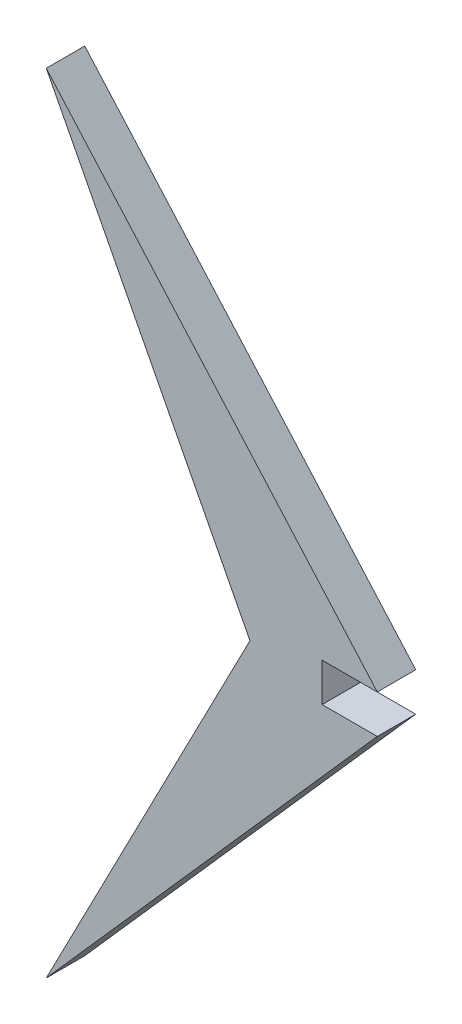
ISO-10303-21;
HEADER;
FILE_DESCRIPTION(('STEP AP214'),'2;1');
FILE_NAME('part.step','',(''),(''),'','','');
FILE_SCHEMA(('AUTOMOTIVE_DESIGN { 1 0 10303 214 1 1 1 1 }'));
ENDSEC;
DATA;
#1=APPLICATION_CONTEXT('core data for automotive mechanical design processes');
#2=APPLICATION_PROTOCOL_DEFINITION('international standard','automotive_design',2000,#1);
#3=PRODUCT_CONTEXT('',#1,'mechanical');
#4=PRODUCT('Part','Part','',(#3));
#5=PRODUCT_RELATED_PRODUCT_CATEGORY('part','',(#4));
#6=PRODUCT_DEFINITION_FORMATION('','',#4);
#7=PRODUCT_DEFINITION_CONTEXT('part definition',#1,'design');
#8=PRODUCT_DEFINITION('design','',#6,#7);
#9=PRODUCT_DEFINITION_SHAPE('','',#8);
#10=(LENGTH_UNIT() NAMED_UNIT(*) SI_UNIT(.MILLI.,.METRE.));
#11=(NAMED_UNIT(*) PLANE_ANGLE_UNIT() SI_UNIT($,.RADIAN.));
#12=(NAMED_UNIT(*) SI_UNIT($,.STERADIAN.) SOLID_ANGLE_UNIT());
#13=UNCERTAINTY_MEASURE_WITH_UNIT(LENGTH_MEASURE(1.E-05),#10,'distance_accuracy_value','');
#14=(GEOMETRIC_REPRESENTATION_CONTEXT(3) GLOBAL_UNCERTAINTY_ASSIGNED_CONTEXT((#13)) GLOBAL_UNIT_ASSIGNED_CONTEXT((#10,
#11,#12)) REPRESENTATION_CONTEXT('',''));
#15=CARTESIAN_POINT('',(0.,0.,0.));
#16=DIRECTION('',(0.,0.,1.));
#17=DIRECTION('',(1.,0.,0.));
#18=AXIS2_PLACEMENT_3D('',#15,#16,#17);
#19=CARTESIAN_POINT('',(211.466705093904,104.,8.));
#20=DIRECTION('',(-0.749476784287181,-0.662030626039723,0.));
#21=DIRECTION('',(0.662030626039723,-0.74947678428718,0.));
#22=AXIS2_PLACEMENT_3D('',#19,#20,#21);
#23=PLANE('',#22);
#24=DIRECTION('',(-0.662030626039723,0.74947678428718,0.));
#25=VECTOR('',#24,1.);
#26=CARTESIAN_POINT('',(211.466705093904,104.,0.));
#27=LINE('',#26,#25);
#28=CARTESIAN_POINT('',(211.466705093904,104.,0.));
#29=VERTEX_POINT('',#28);
#30=CARTESIAN_POINT('',(142.642356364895,181.915204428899,0.));
#31=VERTEX_POINT('',#30);
#32=EDGE_CURVE('E123',#29,#31,#27,.T.);
#33=ORIENTED_EDGE('',*,*,#32,.T.);
#34=DIRECTION('',(0.,0.,-1.));
#35=VECTOR('',#34,1.);
#36=CARTESIAN_POINT('',(142.642356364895,181.915204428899,8.));
#37=LINE('',#36,#35);
#38=CARTESIAN_POINT('',(142.642356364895,181.915204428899,8.));
#39=VERTEX_POINT('',#38);
#40=EDGE_CURVE('E11',#39,#31,#37,.T.);
#41=ORIENTED_EDGE('',*,*,#40,.F.);
#42=DIRECTION('',(-0.662030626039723,0.74947678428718,0.));
#43=VECTOR('',#42,1.);
#44=CARTESIAN_POINT('',(211.466705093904,104.,8.));
#45=LINE('',#44,#43);
#46=CARTESIAN_POINT('',(211.466705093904,104.,8.));
#47=VERTEX_POINT('',#46);
#48=EDGE_CURVE('E135',#47,#39,#45,.T.);
#49=ORIENTED_EDGE('',*,*,#48,.F.);
#50=DIRECTION('',(0.,0.,-1.));
#51=VECTOR('',#50,1.);
#52=CARTESIAN_POINT('',(211.466705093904,104.,8.));
#53=LINE('',#52,#51);
#54=EDGE_CURVE('E119',#47,#29,#53,.T.);
#55=ORIENTED_EDGE('',*,*,#54,.T.);
#56=EDGE_LOOP('',(#33,#41,#49,#55));
#57=FACE_BOUND('',#56,.T.);
#58=ADVANCED_FACE('F33',(#57),#23,.F.);
#59=CARTESIAN_POINT('',(142.642356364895,181.915204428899,8.));
#60=DIRECTION('',(0.888272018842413,0.459317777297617,0.));
#61=DIRECTION('',(-0.459317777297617,0.888272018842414,0.));
#62=AXIS2_PLACEMENT_3D('',#59,#60,#61);
#63=PLANE('',#62);
#64=DIRECTION('',(0.459317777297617,-0.888272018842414,0.));
#65=VECTOR('',#64,1.);
#66=CARTESIAN_POINT('',(142.642356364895,181.915204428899,0.));
#67=LINE('',#66,#65);
#68=CARTESIAN_POINT('',(185.,100.,0.));
#69=VERTEX_POINT('',#68);
#70=EDGE_CURVE('E126',#31,#69,#67,.T.);
#71=ORIENTED_EDGE('',*,*,#70,.T.);
#72=DIRECTION('',(0.,0.,-1.));
#73=VECTOR('',#72,1.);
#74=CARTESIAN_POINT('',(185.,100.,8.));
#75=LINE('',#74,#73);
#76=CARTESIAN_POINT('',(185.,100.,8.));
#77=VERTEX_POINT('',#76);
#78=EDGE_CURVE('E41',#77,#69,#75,.T.);
#79=ORIENTED_EDGE('',*,*,#78,.F.);
#80=DIRECTION('',(0.459317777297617,-0.888272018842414,0.));
#81=VECTOR('',#80,1.);
#82=CARTESIAN_POINT('',(142.642356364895,181.915204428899,8.));
#83=LINE('',#82,#81);
#84=EDGE_CURVE('E89',#39,#77,#83,.T.);
#85=ORIENTED_EDGE('',*,*,#84,.F.);
#86=ORIENTED_EDGE('',*,*,#40,.T.);
#87=EDGE_LOOP('',(#71,#79,#85,#86));
#88=FACE_BOUND('',#87,.T.);
#89=ADVANCED_FACE('F160',(#88),#63,.F.);
#90=CARTESIAN_POINT('',(185.,100.,8.));
#91=DIRECTION('',(0.888272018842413,-0.459317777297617,0.));
#92=DIRECTION('',(0.459317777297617,0.888272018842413,0.));
#93=AXIS2_PLACEMENT_3D('',#90,#91,#92);
#94=PLANE('',#93);
#95=DIRECTION('',(-0.459317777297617,-0.888272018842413,0.));
#96=VECTOR('',#95,1.);
#97=CARTESIAN_POINT('',(185.,100.,0.));
#98=LINE('',#97,#96);
#99=CARTESIAN_POINT('',(142.642356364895,18.0847955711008,0.));
#100=VERTEX_POINT('',#99);
#101=EDGE_CURVE('E128',#69,#100,#98,.T.);
#102=ORIENTED_EDGE('',*,*,#101,.T.);
#103=DIRECTION('',(0.,0.,-1.));
#104=VECTOR('',#103,1.);
#105=CARTESIAN_POINT('',(142.642356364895,18.0847955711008,8.));
#106=LINE('',#105,#104);
#107=CARTESIAN_POINT('',(142.642356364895,18.0847955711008,8.));
#108=VERTEX_POINT('',#107);
#109=EDGE_CURVE('E139',#108,#100,#106,.T.);
#110=ORIENTED_EDGE('',*,*,#109,.F.);
#111=DIRECTION('',(-0.459317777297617,-0.888272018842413,0.));
#112=VECTOR('',#111,1.);
#113=CARTESIAN_POINT('',(185.,100.,8.));
#114=LINE('',#113,#112);
#115=EDGE_CURVE('E147',#77,#108,#114,.T.);
#116=ORIENTED_EDGE('',*,*,#115,.F.);
#117=ORIENTED_EDGE('',*,*,#78,.T.);
#118=EDGE_LOOP('',(#102,#110,#116,#117));
#119=FACE_BOUND('',#118,.T.);
#120=ADVANCED_FACE('F145',(#119),#94,.F.);
#121=CARTESIAN_POINT('',(142.642356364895,18.0847955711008,8.));
#122=DIRECTION('',(-0.74947678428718,0.662030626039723,0.));
#123=DIRECTION('',(-0.662030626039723,-0.74947678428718,0.));
#124=AXIS2_PLACEMENT_3D('',#121,#122,#123);
#125=PLANE('',#124);
#126=DIRECTION('',(0.662030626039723,0.74947678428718,0.));
#127=VECTOR('',#126,1.);
#128=CARTESIAN_POINT('',(142.642356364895,18.0847955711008,0.));
#129=LINE('',#128,#127);
#130=CARTESIAN_POINT('',(211.466705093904,96.,0.));
#131=VERTEX_POINT('',#130);
#132=EDGE_CURVE('E130',#100,#131,#129,.T.);
#133=ORIENTED_EDGE('',*,*,#132,.T.);
#134=DIRECTION('',(0.,0.,-1.));
#135=VECTOR('',#134,1.);
#136=CARTESIAN_POINT('',(211.466705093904,96.,8.));
#137=LINE('',#136,#135);
#138=CARTESIAN_POINT('',(211.466705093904,96.,8.));
#139=VERTEX_POINT('',#138);
#140=EDGE_CURVE('E114',#139,#131,#137,.T.);
#141=ORIENTED_EDGE('',*,*,#140,.F.);
#142=DIRECTION('',(0.662030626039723,0.74947678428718,0.));
#143=VECTOR('',#142,1.);
#144=CARTESIAN_POINT('',(142.642356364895,18.0847955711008,8.));
#145=LINE('',#144,#143);
#146=EDGE_CURVE('E105',#108,#139,#145,.T.);
#147=ORIENTED_EDGE('',*,*,#146,.F.);
#148=ORIENTED_EDGE('',*,*,#109,.T.);
#149=EDGE_LOOP('',(#133,#141,#147,#148));
#150=FACE_BOUND('',#149,.T.);
#151=ADVANCED_FACE('F153',(#150),#125,.F.);
#152=CARTESIAN_POINT('',(200.,96.,8.));
#153=DIRECTION('',(0.,-1.,0.));
#154=DIRECTION('',(0.,0.,-1.));
#155=AXIS2_PLACEMENT_3D('',#152,#153,#154);
#156=PLANE('',#155);
#157=DIRECTION('',(-1.,0.,0.));
#158=VECTOR('',#157,1.);
#159=CARTESIAN_POINT('',(200.,96.,0.));
#160=LINE('',#159,#158);
#161=CARTESIAN_POINT('',(200.,96.,0.));
#162=VERTEX_POINT('',#161);
#163=EDGE_CURVE('E113',#131,#162,#160,.T.);
#164=ORIENTED_EDGE('',*,*,#163,.T.);
#165=DIRECTION('',(0.,0.,-1.));
#166=VECTOR('',#165,1.);
#167=CARTESIAN_POINT('',(200.,96.,8.));
#168=LINE('',#167,#166);
#169=CARTESIAN_POINT('',(200.,96.,8.));
#170=VERTEX_POINT('',#169);
#171=EDGE_CURVE('E110',#170,#162,#168,.T.);
#172=ORIENTED_EDGE('',*,*,#171,.F.);
#173=DIRECTION('',(-1.,0.,0.));
#174=VECTOR('',#173,1.);
#175=CARTESIAN_POINT('',(200.,96.,8.));
#176=LINE('',#175,#174);
#177=EDGE_CURVE('E99',#139,#170,#176,.T.);
#178=ORIENTED_EDGE('',*,*,#177,.F.);
#179=ORIENTED_EDGE('',*,*,#140,.T.);
#180=EDGE_LOOP('',(#164,#172,#178,#179));
#181=FACE_BOUND('',#180,.T.);
#182=ADVANCED_FACE('F111',(#181),#156,.F.);
#183=CARTESIAN_POINT('',(200.,104.,8.));
#184=DIRECTION('',(-1.,0.,0.));
#185=DIRECTION('',(0.,0.,1.));
#186=AXIS2_PLACEMENT_3D('',#183,#184,#185);
#187=PLANE('',#186);
#188=DIRECTION('',(0.,1.,0.));
#189=VECTOR('',#188,1.);
#190=CARTESIAN_POINT('',(200.,104.,0.));
#191=LINE('',#190,#189);
#192=CARTESIAN_POINT('',(200.,104.,0.));
#193=VERTEX_POINT('',#192);
#194=EDGE_CURVE('E75',#162,#193,#191,.T.);
#195=ORIENTED_EDGE('',*,*,#194,.T.);
#196=DIRECTION('',(0.,0.,-1.));
#197=VECTOR('',#196,1.);
#198=CARTESIAN_POINT('',(200.,104.,8.));
#199=LINE('',#198,#197);
#200=CARTESIAN_POINT('',(200.,104.,8.));
#201=VERTEX_POINT('',#200);
#202=EDGE_CURVE('E115',#201,#193,#199,.T.);
#203=ORIENTED_EDGE('',*,*,#202,.F.);
#204=DIRECTION('',(0.,1.,0.));
#205=VECTOR('',#204,1.);
#206=CARTESIAN_POINT('',(200.,104.,8.));
#207=LINE('',#206,#205);
#208=EDGE_CURVE('E103',#170,#201,#207,.T.);
#209=ORIENTED_EDGE('',*,*,#208,.F.);
#210=ORIENTED_EDGE('',*,*,#171,.T.);
#211=EDGE_LOOP('',(#195,#203,#209,#210));
#212=FACE_BOUND('',#211,.T.);
#213=ADVANCED_FACE('F117',(#212),#187,.F.);
#214=CARTESIAN_POINT('',(200.,104.,8.));
#215=DIRECTION('',(0.,1.,0.));
#216=DIRECTION('',(0.,0.,1.));
#217=AXIS2_PLACEMENT_3D('',#214,#215,#216);
#218=PLANE('',#217);
#219=DIRECTION('',(1.,0.,0.));
#220=VECTOR('',#219,1.);
#221=CARTESIAN_POINT('',(200.,104.,0.));
#222=LINE('',#221,#220);
#223=EDGE_CURVE('E81',#193,#29,#222,.T.);
#224=ORIENTED_EDGE('',*,*,#223,.T.);
#225=ORIENTED_EDGE('',*,*,#54,.F.);
#226=DIRECTION('',(1.,0.,0.));
#227=VECTOR('',#226,1.);
#228=CARTESIAN_POINT('',(200.,104.,8.));
#229=LINE('',#228,#227);
#230=EDGE_CURVE('E49',#201,#47,#229,.T.);
#231=ORIENTED_EDGE('',*,*,#230,.F.);
#232=ORIENTED_EDGE('',*,*,#202,.T.);
#233=EDGE_LOOP('',(#224,#225,#231,#232));
#234=FACE_BOUND('',#233,.T.);
#235=ADVANCED_FACE('F174',(#234),#218,.F.);
#236=CARTESIAN_POINT('',(0.,0.,8.));
#237=DIRECTION('',(0.,0.,-1.));
#238=DIRECTION('',(-1.,0.,0.));
#239=AXIS2_PLACEMENT_3D('',#236,#237,#238);
#240=PLANE('',#239);
#241=ORIENTED_EDGE('',*,*,#48,.T.);
#242=ORIENTED_EDGE('',*,*,#84,.T.);
#243=ORIENTED_EDGE('',*,*,#115,.T.);
#244=ORIENTED_EDGE('',*,*,#146,.T.);
#245=ORIENTED_EDGE('',*,*,#177,.T.);
#246=ORIENTED_EDGE('',*,*,#208,.T.);
#247=ORIENTED_EDGE('',*,*,#230,.T.);
#248=EDGE_LOOP('',(#241,#242,#243,#244,#245,#246,#247));
#249=FACE_BOUND('',#248,.T.);
#250=ADVANCED_FACE('F101',(#249),#240,.F.);
#251=CARTESIAN_POINT('',(0.,0.,0.));
#252=DIRECTION('',(0.,0.,-1.));
#253=DIRECTION('',(-1.,0.,0.));
#254=AXIS2_PLACEMENT_3D('',#251,#252,#253);
#255=PLANE('',#254);
#256=ORIENTED_EDGE('',*,*,#32,.F.);
#257=ORIENTED_EDGE('',*,*,#223,.F.);
#258=ORIENTED_EDGE('',*,*,#194,.F.);
#259=ORIENTED_EDGE('',*,*,#163,.F.);
#260=ORIENTED_EDGE('',*,*,#132,.F.);
#261=ORIENTED_EDGE('',*,*,#101,.F.);
#262=ORIENTED_EDGE('',*,*,#70,.F.);
#263=EDGE_LOOP('',(#256,#257,#258,#259,#260,#261,#262));
#264=FACE_BOUND('',#263,.T.);
#265=ADVANCED_FACE('F151',(#264),#255,.T.);
#266=CLOSED_SHELL('',(#58,#89,#120,#151,#182,#213,#235,#250,#265));
#267=MANIFOLD_SOLID_BREP('B2',#266);
#268=ADVANCED_BREP_SHAPE_REPRESENTATION('',(#18,#267),#14);
#269=SHAPE_DEFINITION_REPRESENTATION(#9,#268);
ENDSEC;
END-ISO-10303-21;
